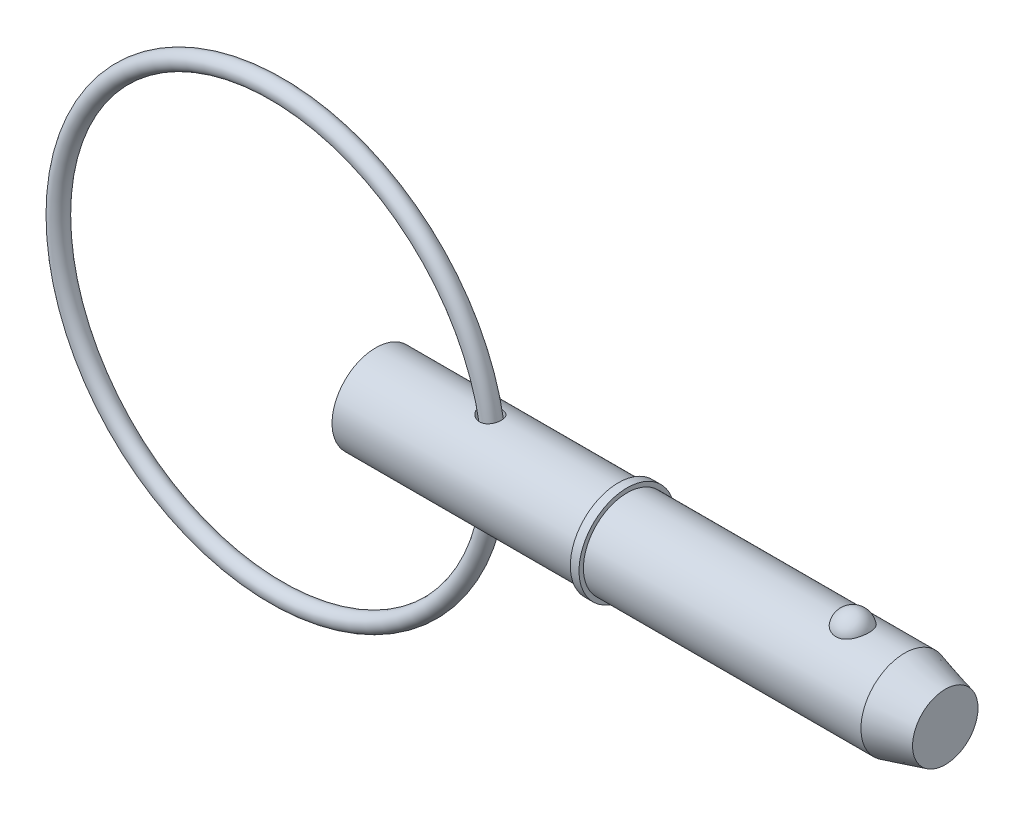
ISO-10303-21;
HEADER;
FILE_DESCRIPTION(('STEP AP214'),'2;1');
FILE_NAME('part.step','',(''),(''),'','','');
FILE_SCHEMA(('AUTOMOTIVE_DESIGN { 1 0 10303 214 1 1 1 1 }'));
ENDSEC;
DATA;
#1=APPLICATION_CONTEXT('core data for automotive mechanical design processes');
#2=APPLICATION_PROTOCOL_DEFINITION('international standard','automotive_design',2000,#1);
#3=PRODUCT_CONTEXT('',#1,'mechanical');
#4=PRODUCT('Part','Part','',(#3));
#5=PRODUCT_RELATED_PRODUCT_CATEGORY('part','',(#4));
#6=PRODUCT_DEFINITION_FORMATION('','',#4);
#7=PRODUCT_DEFINITION_CONTEXT('part definition',#1,'design');
#8=PRODUCT_DEFINITION('design','',#6,#7);
#9=PRODUCT_DEFINITION_SHAPE('','',#8);
#10=(LENGTH_UNIT() NAMED_UNIT(*) SI_UNIT(.MILLI.,.METRE.));
#11=(NAMED_UNIT(*) PLANE_ANGLE_UNIT() SI_UNIT($,.RADIAN.));
#12=(NAMED_UNIT(*) SI_UNIT($,.STERADIAN.) SOLID_ANGLE_UNIT());
#13=UNCERTAINTY_MEASURE_WITH_UNIT(LENGTH_MEASURE(1.E-05),#10,'distance_accuracy_value','');
#14=(GEOMETRIC_REPRESENTATION_CONTEXT(3) GLOBAL_UNCERTAINTY_ASSIGNED_CONTEXT((#13)) GLOBAL_UNIT_ASSIGNED_CONTEXT((#10,
#11,#12)) REPRESENTATION_CONTEXT('',''));
#15=CARTESIAN_POINT('',(0.,0.,0.));
#16=DIRECTION('',(0.,0.,1.));
#17=DIRECTION('',(1.,0.,0.));
#18=AXIS2_PLACEMENT_3D('',#15,#16,#17);
#19=CARTESIAN_POINT('',(-7.21857545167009,0.,0.));
#20=DIRECTION('',(0.,0.,1.));
#21=DIRECTION('',(1.,0.,0.));
#22=AXIS2_PLACEMENT_3D('',#19,#20,#21);
#23=TOROIDAL_SURFACE('',#22,15.875,0.634999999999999);
#24=CARTESIAN_POINT('',(9.29142454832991,0.,0.));
#25=VERTEX_POINT('',#24);
#26=VERTEX_LOOP('',#25);
#27=FACE_BOUND('',#26,.T.);
#28=ADVANCED_FACE('P0_F12',(#27),#23,.T.);
#29=CLOSED_SHELL('',(#28));
#30=MANIFOLD_SOLID_BREP('P0_B1',#29);
#31=CARTESIAN_POINT('',(0.,0.,0.));
#32=DIRECTION('',(1.,0.,0.));
#33=DIRECTION('',(0.,0.,-1.));
#34=AXIS2_PLACEMENT_3D('',#31,#32,#33);
#35=CYLINDRICAL_SURFACE('',#34,3.175);
#36=CARTESIAN_POINT('',(7.61208756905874,3.1556298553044,-0.35017883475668));
#37=CARTESIAN_POINT('',(7.63371620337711,3.15106857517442,-0.391277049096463));
#38=CARTESIAN_POINT('',(7.65900587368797,3.14590738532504,-0.430417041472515));
#39=CARTESIAN_POINT('',(7.71586762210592,3.13499707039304,-0.503788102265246));
#40=CARTESIAN_POINT('',(7.74745045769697,3.12924694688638,-0.538010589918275));
#41=CARTESIAN_POINT('',(7.81573449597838,3.11782384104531,-0.600675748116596));
#42=CARTESIAN_POINT('',(7.85242014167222,3.11215067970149,-0.629135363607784));
#43=CARTESIAN_POINT('',(7.9299616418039,3.10148180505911,-0.679784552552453));
#44=CARTESIAN_POINT('',(7.97081650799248,3.0964859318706,-0.701975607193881));
#45=CARTESIAN_POINT('',(8.05731415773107,3.08756286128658,-0.740259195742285));
#46=CARTESIAN_POINT('',(8.10308043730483,3.08368396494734,-0.756085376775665));
#47=CARTESIAN_POINT('',(8.19675033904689,3.07777545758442,-0.779791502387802));
#48=CARTESIAN_POINT('',(8.24465368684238,3.07574560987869,-0.787672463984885));
#49=CARTESIAN_POINT('',(8.33978659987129,3.07388057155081,-0.794919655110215));
#50=CARTESIAN_POINT('',(8.38699681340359,3.07398484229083,-0.794520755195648));
#51=CARTESIAN_POINT('',(8.48058476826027,3.07628376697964,-0.785572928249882));
#52=CARTESIAN_POINT('',(8.52696281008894,3.07847765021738,-0.777027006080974));
#53=CARTESIAN_POINT('',(8.61487038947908,3.08453758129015,-0.752595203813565));
#54=CARTESIAN_POINT('',(8.65652632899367,3.0883052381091,-0.737137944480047));
#55=CARTESIAN_POINT('',(8.73650065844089,3.09706199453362,-0.69943165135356));
#56=CARTESIAN_POINT('',(8.77481931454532,3.10205099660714,-0.677183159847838));
#57=CARTESIAN_POINT('',(8.84638246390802,3.11258194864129,-0.62697851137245));
#58=CARTESIAN_POINT('',(8.87970556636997,3.11811239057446,-0.599131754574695));
#59=CARTESIAN_POINT('',(8.94123162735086,3.12919300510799,-0.538266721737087));
#60=CARTESIAN_POINT('',(8.96943428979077,3.1347431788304,-0.505248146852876));
#61=CARTESIAN_POINT('',(9.02036334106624,3.14533698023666,-0.434482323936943));
#62=CARTESIAN_POINT('',(9.04301290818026,3.15037299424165,-0.396678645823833));
#63=CARTESIAN_POINT('',(9.08180072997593,3.15931021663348,-0.317742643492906));
#64=CARTESIAN_POINT('',(9.0979387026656,3.1632113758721,-0.27661017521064));
#65=CARTESIAN_POINT('',(9.12343544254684,3.16949230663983,-0.191753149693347));
#66=CARTESIAN_POINT('',(9.13272827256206,3.17185725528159,-0.148007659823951));
#67=CARTESIAN_POINT('',(9.14405176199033,3.17475043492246,-0.0595274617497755));
#68=CARTESIAN_POINT('',(9.14608246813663,3.17527867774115,-0.0147927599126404));
#69=CARTESIAN_POINT('',(9.1428335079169,3.1744420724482,0.0743443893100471));
#70=CARTESIAN_POINT('',(9.13756166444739,3.17307925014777,0.118747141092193));
#71=CARTESIAN_POINT('',(9.11985162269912,3.1686108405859,0.206009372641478));
#72=CARTESIAN_POINT('',(9.10741326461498,3.16550521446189,0.248868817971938));
#73=CARTESIAN_POINT('',(9.07566875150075,3.1578851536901,0.331849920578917));
#74=CARTESIAN_POINT('',(9.05635986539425,3.15337015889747,0.371970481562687));
#75=CARTESIAN_POINT('',(9.01134716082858,3.14342392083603,0.448324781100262));
#76=CARTESIAN_POINT('',(8.98564319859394,3.13799265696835,0.484558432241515));
#77=CARTESIAN_POINT('',(8.92847529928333,3.12681455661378,0.552114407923));
#78=CARTESIAN_POINT('',(8.89701024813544,3.12106765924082,0.583435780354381));
#79=CARTESIAN_POINT('',(8.82914631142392,3.10991074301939,0.640250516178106));
#80=CARTESIAN_POINT('',(8.79274799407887,3.10450068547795,0.665744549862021));
#81=CARTESIAN_POINT('',(8.71647895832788,3.09469918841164,0.709908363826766));
#82=CARTESIAN_POINT('',(8.6766541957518,3.09029650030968,0.728654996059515));
#83=CARTESIAN_POINT('',(8.59431583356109,3.08292493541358,0.759241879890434));
#84=CARTESIAN_POINT('',(8.55180254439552,3.07995589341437,0.771082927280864));
#85=CARTESIAN_POINT('',(8.46578539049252,3.07578939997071,0.787538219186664));
#86=CARTESIAN_POINT('',(8.42229655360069,3.07457372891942,0.792226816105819));
#87=CARTESIAN_POINT('',(8.33511786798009,3.07395008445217,0.794642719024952));
#88=CARTESIAN_POINT('',(8.29142799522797,3.07454233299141,0.792369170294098));
#89=CARTESIAN_POINT('',(8.20393675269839,3.07746038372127,0.7809593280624));
#90=CARTESIAN_POINT('',(8.16015857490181,3.07982804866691,0.771657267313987));
#91=CARTESIAN_POINT('',(8.07467704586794,3.08604667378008,0.746397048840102));
#92=CARTESIAN_POINT('',(8.03297433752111,3.08989809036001,0.730436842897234));
#93=CARTESIAN_POINT('',(7.95039160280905,3.09890222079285,0.691270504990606));
#94=CARTESIAN_POINT('',(7.90968495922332,3.10411517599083,0.667712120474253));
#95=CARTESIAN_POINT('',(7.83271969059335,3.1151281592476,0.614283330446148));
#96=CARTESIAN_POINT('',(7.79646250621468,3.12092837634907,0.584410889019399));
#97=CARTESIAN_POINT('',(7.72857688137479,3.13262084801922,0.518141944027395));
#98=CARTESIAN_POINT('',(7.69709348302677,3.13851156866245,0.481595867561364));
#99=CARTESIAN_POINT('',(7.64110131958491,3.14951669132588,0.403390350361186));
#100=CARTESIAN_POINT('',(7.61658964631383,3.15463141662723,0.361733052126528));
#101=CARTESIAN_POINT('',(7.57680170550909,3.16317869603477,0.276844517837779));
#102=CARTESIAN_POINT('',(7.56109307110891,3.16668805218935,0.233824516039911));
#103=CARTESIAN_POINT('',(7.53774475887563,3.17196948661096,0.145544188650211));
#104=CARTESIAN_POINT('',(7.53010042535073,3.17374256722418,0.100285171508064));
#105=CARTESIAN_POINT('',(7.52361520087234,3.17524561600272,0.0131362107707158));
#106=CARTESIAN_POINT('',(7.52405785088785,3.17514186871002,-0.0286991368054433));
#107=CARTESIAN_POINT('',(7.53198606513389,3.17330730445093,-0.11163297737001));
#108=CARTESIAN_POINT('',(7.53946515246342,3.17157798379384,-0.152732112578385));
#109=CARTESIAN_POINT('',(7.55761776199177,3.16747587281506,-0.220170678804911));
#110=CARTESIAN_POINT('',(7.56650761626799,3.16548510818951,-0.24703103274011));
#111=CARTESIAN_POINT('',(7.58717790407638,3.16094651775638,-0.299561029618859));
#112=CARTESIAN_POINT('',(7.59895820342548,3.15839871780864,-0.325230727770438));
#113=CARTESIAN_POINT('',(7.61208756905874,3.1556298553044,-0.35017883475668));
#114=B_SPLINE_CURVE_WITH_KNOTS('',3,(#36,#37,#38,#39,#40,#41,#42,#43,#44,#45,#46,#47,#48,#49,
#50,#51,#52,#53,#54,#55,#56,#57,#58,#59,#60,#61,#62,#63,#64,#65,#66,#67,#68,#69,#70,#71,#72,#73,
#74,#75,#76,#77,#78,#79,#80,#81,#82,#83,#84,#85,#86,#87,#88,#89,#90,#91,#92,#93,#94,#95,#96,#97,
#98,#99,#100,#101,#102,#103,#104,#105,#106,#107,#108,#109,#110,#111,#112,#113),.UNSPECIFIED.,
.T.,.F.,(4,2,2,2,2,2,2,2,2,2,2,2,2,2,2,2,2,2,2,2,2,2,2,2,2,2,2,2,2,2,2,2,2,2,2,2,2,2,4),(0.,
0.139884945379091,0.280011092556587,0.419719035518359,0.559393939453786,0.704422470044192,
0.849432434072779,0.990334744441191,1.13118510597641,1.26430449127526,1.39741324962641,
1.52813722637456,1.65886875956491,1.79131797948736,1.92377293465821,2.05748767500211,
2.19120155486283,2.32477230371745,2.45834603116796,2.5919729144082,2.72560280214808,
2.8592585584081,2.9928989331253,3.12496502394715,3.25701589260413,3.3876844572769,
3.51836906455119,3.65223598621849,3.78614411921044,3.92746618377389,4.06883388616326,
4.21388116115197,4.35886784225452,4.4959119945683,4.63287698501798,4.75777153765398,
4.88255123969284,4.9674704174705,5.05238565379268),.UNSPECIFIED.);
#115=CARTESIAN_POINT('',(7.61208756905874,3.1556298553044,-0.35017883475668));
#116=VERTEX_POINT('',#115);
#117=EDGE_CURVE('P1_E42',#116,#116,#114,.T.);
#118=ORIENTED_EDGE('',*,*,#117,.T.);
#119=EDGE_LOOP('',(#118));
#120=FACE_BOUND('',#119,.T.);
#121=CARTESIAN_POINT('',(0.,0.,0.));
#122=DIRECTION('',(1.,0.,0.));
#123=DIRECTION('',(0.,0.,-1.));
#124=AXIS2_PLACEMENT_3D('',#121,#122,#123);
#125=CIRCLE('',#124,3.175);
#126=CARTESIAN_POINT('',(0.,0.,-3.175));
#127=VERTEX_POINT('',#126);
#128=EDGE_CURVE('P1_E9',#127,#127,#125,.T.);
#129=ORIENTED_EDGE('',*,*,#128,.T.);
#130=EDGE_LOOP('',(#129));
#131=FACE_BOUND('',#130,.T.);
#132=CARTESIAN_POINT('',(17.655,0.,0.));
#133=DIRECTION('',(1.,0.,0.));
#134=DIRECTION('',(0.,0.,-1.));
#135=AXIS2_PLACEMENT_3D('',#132,#133,#134);
#136=CIRCLE('',#135,3.175);
#137=CARTESIAN_POINT('',(17.655,0.,-3.175));
#138=VERTEX_POINT('',#137);
#139=EDGE_CURVE('P1_E25',#138,#138,#136,.T.);
#140=ORIENTED_EDGE('',*,*,#139,.F.);
#141=EDGE_LOOP('',(#140));
#142=FACE_BOUND('',#141,.T.);
#143=CARTESIAN_POINT('',(7.61208756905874,-3.1556298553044,-0.35017883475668));
#144=CARTESIAN_POINT('',(7.59286963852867,-3.15968249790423,-0.313658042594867));
#145=CARTESIAN_POINT('',(7.57653057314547,-3.16326353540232,-0.275569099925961));
#146=CARTESIAN_POINT('',(7.55026251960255,-3.16911690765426,-0.197144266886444));
#147=CARTESIAN_POINT('',(7.5403309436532,-3.17138977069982,-0.156809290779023));
#148=CARTESIAN_POINT('',(7.52732229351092,-3.17438133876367,-0.0748996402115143));
#149=CARTESIAN_POINT('',(7.52425928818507,-3.17509685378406,-0.0333225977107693));
#150=CARTESIAN_POINT('',(7.52518511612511,-3.17488190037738,0.0497488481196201));
#151=CARTESIAN_POINT('',(7.52917391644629,-3.17395143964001,0.0912432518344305));
#152=CARTESIAN_POINT('',(7.5438119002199,-3.17059494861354,0.171876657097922));
#153=CARTESIAN_POINT('',(7.55428987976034,-3.16820738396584,0.211048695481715));
#154=CARTESIAN_POINT('',(7.58129107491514,-3.16221942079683,0.287144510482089));
#155=CARTESIAN_POINT('',(7.59781536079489,-3.15861880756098,0.324067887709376));
#156=CARTESIAN_POINT('',(7.63709105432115,-3.15038497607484,0.39633030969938));
#157=CARTESIAN_POINT('',(7.66007308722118,-3.14571500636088,0.431539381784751));
#158=CARTESIAN_POINT('',(7.71115516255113,-3.1358897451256,0.497945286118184));
#159=CARTESIAN_POINT('',(7.73925713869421,-3.13073427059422,0.529140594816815));
#160=CARTESIAN_POINT('',(7.80245490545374,-3.11995925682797,0.589491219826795));
#161=CARTESIAN_POINT('',(7.83794667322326,-3.11433841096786,0.618232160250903));
#162=CARTESIAN_POINT('',(7.91311816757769,-3.10367079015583,0.669735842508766));
#163=CARTESIAN_POINT('',(7.9527994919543,-3.09862423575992,0.692496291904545));
#164=CARTESIAN_POINT('',(8.0376108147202,-3.08940933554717,0.732544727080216));
#165=CARTESIAN_POINT('',(8.08291928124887,-3.08530306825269,0.749471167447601));
#166=CARTESIAN_POINT('',(8.17586222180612,-3.07887185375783,0.775470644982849));
#167=CARTESIAN_POINT('',(8.22349631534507,-3.07654661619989,0.784544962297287));
#168=CARTESIAN_POINT('',(8.31855368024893,-3.0740583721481,0.794238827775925));
#169=CARTESIAN_POINT('',(8.365955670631,-3.0738459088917,0.795051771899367));
#170=CARTESIAN_POINT('',(8.46014660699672,-3.07554059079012,0.788471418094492));
#171=CARTESIAN_POINT('',(8.50693577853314,-3.07744693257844,0.781081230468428));
#172=CARTESIAN_POINT('',(8.59580031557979,-3.08301185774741,0.75880456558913));
#173=CARTESIAN_POINT('',(8.63799306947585,-3.0865668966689,0.744358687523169));
#174=CARTESIAN_POINT('',(8.71919510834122,-3.09498125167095,0.708556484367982));
#175=CARTESIAN_POINT('',(8.75820469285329,-3.09984044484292,0.687200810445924));
#176=CARTESIAN_POINT('',(8.83112932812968,-3.11018970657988,0.638704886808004));
#177=CARTESIAN_POINT('',(8.86513521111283,-3.11566412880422,0.6116975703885));
#178=CARTESIAN_POINT('',(8.92814452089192,-3.1267232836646,0.552389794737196));
#179=CARTESIAN_POINT('',(8.95714769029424,-3.13230802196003,0.520089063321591));
#180=CARTESIAN_POINT('',(9.00975680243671,-3.1430519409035,0.450661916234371));
#181=CARTESIAN_POINT('',(9.03329284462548,-3.14820512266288,0.413481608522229));
#182=CARTESIAN_POINT('',(9.07393955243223,-3.15745247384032,0.335639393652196));
#183=CARTESIAN_POINT('',(9.09104990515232,-3.16154659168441,0.294977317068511));
#184=CARTESIAN_POINT('',(9.11857731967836,-3.16827429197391,0.21085639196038));
#185=CARTESIAN_POINT('',(9.12892253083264,-3.1708921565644,0.167372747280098));
#186=CARTESIAN_POINT('',(9.14237674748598,-3.17431758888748,0.0792307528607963));
#187=CARTESIAN_POINT('',(9.14548579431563,-3.17512516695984,0.0345724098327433));
#188=CARTESIAN_POINT('',(9.14439142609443,-3.17484319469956,-0.0546175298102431));
#189=CARTESIAN_POINT('',(9.14019308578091,-3.17375496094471,-0.0991491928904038));
#190=CARTESIAN_POINT('',(9.12459742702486,-3.16980106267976,-0.186852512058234));
#191=CARTESIAN_POINT('',(9.11319997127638,-3.16693536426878,-0.230024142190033));
#192=CARTESIAN_POINT('',(9.08348483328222,-3.15973571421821,-0.313789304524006));
#193=CARTESIAN_POINT('',(9.06516665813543,-3.15540165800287,-0.354382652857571));
#194=CARTESIAN_POINT('',(9.02205745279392,-3.14573679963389,-0.431845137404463));
#195=CARTESIAN_POINT('',(8.99726624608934,-3.14040597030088,-0.468714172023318));
#196=CARTESIAN_POINT('',(8.94180687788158,-3.12933254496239,-0.53770470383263));
#197=CARTESIAN_POINT('',(8.91113471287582,-3.12358967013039,-0.569822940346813));
#198=CARTESIAN_POINT('',(8.84472020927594,-3.11234460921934,-0.628352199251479));
#199=CARTESIAN_POINT('',(8.80897839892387,-3.10684239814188,-0.654763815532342));
#200=CARTESIAN_POINT('',(8.73381844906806,-3.0967672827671,-0.700864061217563));
#201=CARTESIAN_POINT('',(8.69444454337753,-3.09218491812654,-0.720622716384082));
#202=CARTESIAN_POINT('',(8.61282389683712,-3.08439406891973,-0.75327416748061));
#203=CARTESIAN_POINT('',(8.57057751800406,-3.08118541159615,-0.766167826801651));
#204=CARTESIAN_POINT('',(8.48495851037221,-3.07651651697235,-0.784705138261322));
#205=CARTESIAN_POINT('',(8.44160497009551,-3.07503616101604,-0.7904322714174));
#206=CARTESIAN_POINT('',(8.35452054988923,-3.07388232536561,-0.794907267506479));
#207=CARTESIAN_POINT('',(8.31078963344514,-3.07420902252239,-0.793654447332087));
#208=CARTESIAN_POINT('',(8.22319164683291,-3.07661365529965,-0.784281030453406));
#209=CARTESIAN_POINT('',(8.17934121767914,-3.07872844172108,-0.776015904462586));
#210=CARTESIAN_POINT('',(8.09354825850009,-3.08448489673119,-0.752807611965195));
#211=CARTESIAN_POINT('',(8.05160636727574,-3.08812707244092,-0.737862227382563));
#212=CARTESIAN_POINT('',(7.9683964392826,-3.09676294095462,-0.700760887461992));
#213=CARTESIAN_POINT('',(7.92729071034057,-3.10181965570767,-0.678255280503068));
#214=CARTESIAN_POINT('',(7.84934481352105,-3.11260576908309,-0.626894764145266));
#215=CARTESIAN_POINT('',(7.81250545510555,-3.11833529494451,-0.598038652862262));
#216=CARTESIAN_POINT('',(7.74486652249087,-3.12971026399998,-0.535287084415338));
#217=CARTESIAN_POINT('',(7.71395414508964,-3.13535486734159,-0.50151327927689));
#218=CARTESIAN_POINT('',(7.65821444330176,-3.14606907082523,-0.429192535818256));
#219=CARTESIAN_POINT('',(7.63338346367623,-3.15113901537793,-0.390648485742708));
#220=CARTESIAN_POINT('',(7.61208756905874,-3.1556298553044,-0.35017883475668));
#221=B_SPLINE_CURVE_WITH_KNOTS('',3,(#143,#144,#145,#146,#147,#148,#149,#150,#151,#152,#153,
#154,#155,#156,#157,#158,#159,#160,#161,#162,#163,#164,#165,#166,#167,#168,#169,#170,#171,#172,
#173,#174,#175,#176,#177,#178,#179,#180,#181,#182,#183,#184,#185,#186,#187,#188,#189,#190,#191,
#192,#193,#194,#195,#196,#197,#198,#199,#200,#201,#202,#203,#204,#205,#206,#207,#208,#209,#210,
#211,#212,#213,#214,#215,#216,#217,#218,#219,#220),.UNSPECIFIED.,.T.,.F.,(4,2,2,2,2,2,2,2,2,2,2,
2,2,2,2,2,2,2,2,2,2,2,2,2,2,2,2,2,2,2,2,2,2,2,2,2,2,2,4),(0.,0.124257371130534,0.24846452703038,
0.372925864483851,0.497386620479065,0.618695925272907,0.740026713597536,0.86640919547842,
0.992839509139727,1.13028244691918,1.26777799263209,1.41269245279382,1.55758328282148,
1.69907422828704,1.84051154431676,1.97406862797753,2.10761312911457,2.23831247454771,
2.36901854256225,2.5013136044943,2.63361510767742,2.76729986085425,2.90098385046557,
3.03457503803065,3.16816877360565,3.3017720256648,3.43537892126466,3.56907709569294,
3.70276134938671,3.83499098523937,3.96720398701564,4.09786208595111,4.22853297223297,
4.36196440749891,4.49544017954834,4.63621591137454,4.77701830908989,4.91479418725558,
5.05248705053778),.UNSPECIFIED.);
#222=CARTESIAN_POINT('',(7.61208756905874,-3.1556298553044,-0.35017883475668));
#223=VERTEX_POINT('',#222);
#224=EDGE_CURVE('P1_E17',#223,#223,#221,.T.);
#225=ORIENTED_EDGE('',*,*,#224,.T.);
#226=EDGE_LOOP('',(#225));
#227=FACE_BOUND('',#226,.T.);
#228=ADVANCED_FACE('P1_F13',(#120,#131,#142,#227),#35,.T.);
#229=CARTESIAN_POINT('',(0.,0.,0.));
#230=DIRECTION('',(1.,0.,0.));
#231=DIRECTION('',(0.,0.,-1.));
#232=AXIS2_PLACEMENT_3D('',#229,#230,#231);
#233=CYLINDRICAL_SURFACE('',#232,3.175);
#234=CARTESIAN_POINT('',(38.4876846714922,0.,0.));
#235=DIRECTION('',(1.,0.,0.));
#236=DIRECTION('',(0.,0.,-1.));
#237=AXIS2_PLACEMENT_3D('',#234,#235,#236);
#238=CIRCLE('',#237,3.175);
#239=CARTESIAN_POINT('',(38.4876846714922,0.,-3.175));
#240=VERTEX_POINT('',#239);
#241=EDGE_CURVE('P1_E99',#240,#240,#238,.T.);
#242=ORIENTED_EDGE('',*,*,#241,.F.);
#243=EDGE_LOOP('',(#242));
#244=FACE_BOUND('',#243,.T.);
#245=CARTESIAN_POINT('',(18.29,0.,0.));
#246=DIRECTION('',(1.,0.,0.));
#247=DIRECTION('',(0.,0.,-1.));
#248=AXIS2_PLACEMENT_3D('',#245,#246,#247);
#249=CIRCLE('',#248,3.175);
#250=CARTESIAN_POINT('',(18.29,0.,-3.175));
#251=VERTEX_POINT('',#250);
#252=EDGE_CURVE('P1_E96',#251,#251,#249,.T.);
#253=ORIENTED_EDGE('',*,*,#252,.T.);
#254=EDGE_LOOP('',(#253));
#255=FACE_BOUND('',#254,.T.);
#256=CARTESIAN_POINT('',(34.7157276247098,2.92898950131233,1.2254164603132));
#257=CARTESIAN_POINT('',(34.652316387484,2.92899434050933,1.22541146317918));
#258=CARTESIAN_POINT('',(34.5887979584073,2.93112688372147,1.2203464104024));
#259=CARTESIAN_POINT('',(34.4635306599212,2.93942752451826,1.20020949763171));
#260=CARTESIAN_POINT('',(34.4017869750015,2.9456063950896,1.1851109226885));
#261=CARTESIAN_POINT('',(34.2820651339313,2.96127115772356,1.14540352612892));
#262=CARTESIAN_POINT('',(34.2240775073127,2.97074831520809,1.12081980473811));
#263=CARTESIAN_POINT('',(34.1131943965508,2.99197584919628,1.06285154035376));
#264=CARTESIAN_POINT('',(34.0602966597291,3.0037252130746,1.02947091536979));
#265=CARTESIAN_POINT('',(33.9592688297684,3.02865714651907,0.95367409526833));
#266=CARTESIAN_POINT('',(33.9113240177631,3.04187163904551,0.911021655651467));
#267=CARTESIAN_POINT('',(33.8230360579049,3.06808741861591,0.818400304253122));
#268=CARTESIAN_POINT('',(33.7826952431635,3.08108863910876,0.768429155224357));
#269=CARTESIAN_POINT('',(33.7088039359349,3.10614903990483,0.660064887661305));
#270=CARTESIAN_POINT('',(33.6756330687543,3.11814104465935,0.601396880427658));
#271=CARTESIAN_POINT('',(33.6191190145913,3.13926931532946,0.479026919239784));
#272=CARTESIAN_POINT('',(33.5957764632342,3.14840539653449,0.415324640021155));
#273=CARTESIAN_POINT('',(33.5591785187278,3.16298160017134,0.283885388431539));
#274=CARTESIAN_POINT('',(33.5460407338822,3.16837855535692,0.216110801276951));
#275=CARTESIAN_POINT('',(33.5305676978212,3.17475386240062,0.0791367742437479));
#276=CARTESIAN_POINT('',(33.528232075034,3.17573236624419,0.00993738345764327));
#277=CARTESIAN_POINT('',(33.5343886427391,3.17318075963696,-0.127420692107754));
#278=CARTESIAN_POINT('',(33.5428073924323,3.16968122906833,-0.195583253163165));
#279=CARTESIAN_POINT('',(33.5701752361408,3.1585790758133,-0.329413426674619));
#280=CARTESIAN_POINT('',(33.5891245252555,3.15097637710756,-0.395080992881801));
#281=CARTESIAN_POINT('',(33.6372057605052,3.13242485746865,-0.522180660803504));
#282=CARTESIAN_POINT('',(33.6663524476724,3.12147119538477,-0.58360647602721));
#283=CARTESIAN_POINT('',(33.7342352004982,3.09734973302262,-0.700436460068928));
#284=CARTESIAN_POINT('',(33.772972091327,3.08418174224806,-0.7558401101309));
#285=CARTESIAN_POINT('',(33.8594771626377,3.05694884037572,-0.859404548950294));
#286=CARTESIAN_POINT('',(33.9072961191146,3.04287919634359,-0.907521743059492));
#287=CARTESIAN_POINT('',(34.0107353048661,3.01548927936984,-0.994758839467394));
#288=CARTESIAN_POINT('',(34.0663549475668,3.0021689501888,-1.03387941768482));
#289=CARTESIAN_POINT('',(34.1828093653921,2.97810316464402,-1.10126594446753));
#290=CARTESIAN_POINT('',(34.2435182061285,2.96731170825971,-1.12973256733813));
#291=CARTESIAN_POINT('',(34.3693712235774,2.9492893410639,-1.17598467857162));
#292=CARTESIAN_POINT('',(34.4345137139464,2.94205708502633,-1.19377420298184));
#293=CARTESIAN_POINT('',(34.5638562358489,2.93233065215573,-1.21746387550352));
#294=CARTESIAN_POINT('',(34.6279385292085,2.92961621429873,-1.22391763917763));
#295=CARTESIAN_POINT('',(34.7563375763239,2.92855752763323,-1.22644976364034));
#296=CARTESIAN_POINT('',(34.8206542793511,2.93021238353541,-1.22253024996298));
#297=CARTESIAN_POINT('',(34.9455239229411,2.9375685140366,-1.20474140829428));
#298=CARTESIAN_POINT('',(35.006131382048,2.94313790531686,-1.19119621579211));
#299=CARTESIAN_POINT('',(35.1241106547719,2.95756226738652,-1.15491492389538));
#300=CARTESIAN_POINT('',(35.1814822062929,2.96641750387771,-1.13217808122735));
#301=CARTESIAN_POINT('',(35.2927699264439,2.98669918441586,-1.07755083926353));
#302=CARTESIAN_POINT('',(35.3465845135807,2.9981771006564,-1.0454730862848));
#303=CARTESIAN_POINT('',(35.4481473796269,3.02240235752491,-0.973220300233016));
#304=CARTESIAN_POINT('',(35.4958942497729,3.03514999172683,-0.933043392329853));
#305=CARTESIAN_POINT('',(35.5865817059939,3.06131230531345,-0.843372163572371));
#306=CARTESIAN_POINT('',(35.6291588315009,3.07472822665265,-0.793510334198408));
#307=CARTESIAN_POINT('',(35.7056765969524,3.10021106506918,-0.687241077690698));
#308=CARTESIAN_POINT('',(35.7396156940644,3.1122777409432,-0.630832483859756));
#309=CARTESIAN_POINT('',(35.7991209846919,3.134208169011,-0.511059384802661));
#310=CARTESIAN_POINT('',(35.8243892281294,3.14399040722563,-0.447531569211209));
#311=CARTESIAN_POINT('',(35.8645117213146,3.15983820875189,-0.316827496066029));
#312=CARTESIAN_POINT('',(35.8793659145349,3.16590375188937,-0.249651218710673));
#313=CARTESIAN_POINT('',(35.898358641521,3.17370076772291,-0.11354918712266));
#314=CARTESIAN_POINT('',(35.9024966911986,3.17543204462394,-0.0446233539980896));
#315=CARTESIAN_POINT('',(35.8999697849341,3.17438372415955,0.0929938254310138));
#316=CARTESIAN_POINT('',(35.8933050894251,3.17160423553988,0.161685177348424));
#317=CARTESIAN_POINT('',(35.8693754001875,3.1618438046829,0.29650259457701));
#318=CARTESIAN_POINT('',(35.8521674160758,3.15488546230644,0.362640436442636));
#319=CARTESIAN_POINT('',(35.8075470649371,3.13748892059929,0.490896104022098));
#320=CARTESIAN_POINT('',(35.7801339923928,3.12705048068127,0.553013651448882));
#321=CARTESIAN_POINT('',(35.7154626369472,3.10369139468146,0.671876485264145));
#322=CARTESIAN_POINT('',(35.6781467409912,3.0907563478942,0.728587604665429));
#323=CARTESIAN_POINT('',(35.5945246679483,3.06381731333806,0.834653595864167));
#324=CARTESIAN_POINT('',(35.5482189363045,3.04981337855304,0.88400883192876));
#325=CARTESIAN_POINT('',(35.4477184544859,3.02230423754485,0.973916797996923));
#326=CARTESIAN_POINT('',(35.393535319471,3.00879833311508,1.01448227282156));
#327=CARTESIAN_POINT('',(35.2785299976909,2.98383625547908,1.0857155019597));
#328=CARTESIAN_POINT('',(35.2177053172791,2.9723808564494,1.11637952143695));
#329=CARTESIAN_POINT('',(35.0933690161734,2.95329063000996,1.16592590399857));
#330=CARTESIAN_POINT('',(35.0300230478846,2.9455373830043,1.18517901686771));
#331=CARTESIAN_POINT('',(34.9007664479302,2.9342556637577,1.21284802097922));
#332=CARTESIAN_POINT('',(34.8348641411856,2.93071450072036,1.2212964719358));
#333=CARTESIAN_POINT('',(34.751116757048,2.9291525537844,1.22502505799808));
#334=CARTESIAN_POINT('',(34.7334263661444,2.92898815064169,1.22541785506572));
#335=CARTESIAN_POINT('',(34.7157276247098,2.92898950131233,1.2254164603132));
#336=B_SPLINE_CURVE_WITH_KNOTS('',3,(#256,#257,#258,#259,#260,#261,#262,#263,#264,#265,#266,
#267,#268,#269,#270,#271,#272,#273,#274,#275,#276,#277,#278,#279,#280,#281,#282,#283,#284,#285,
#286,#287,#288,#289,#290,#291,#292,#293,#294,#295,#296,#297,#298,#299,#300,#301,#302,#303,#304,
#305,#306,#307,#308,#309,#310,#311,#312,#313,#314,#315,#316,#317,#318,#319,#320,#321,#322,#323,
#324,#325,#326,#327,#328,#329,#330,#331,#332,#333,#334,#335),.UNSPECIFIED.,.T.,.F.,(4,2,2,2,2,2,
2,2,2,2,2,2,2,2,2,2,2,2,2,2,2,2,2,2,2,2,2,2,2,2,2,2,2,2,2,2,2,2,2,4),(0.,0.190186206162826,
0.380880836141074,0.571074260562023,0.761183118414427,0.956866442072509,1.1526097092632,
1.35701770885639,1.56143892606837,1.76818248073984,1.97491892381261,2.18025109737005,
2.38558707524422,2.59122111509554,2.79687285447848,3.00371012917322,3.21053185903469,
3.41323429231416,3.61586005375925,3.80828192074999,4.00066436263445,4.18685798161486,
4.37306665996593,4.56330302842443,4.75358348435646,4.95345287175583,5.15335793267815,
5.35957003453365,5.56578325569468,5.7720057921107,5.97822335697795,6.18333558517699,
6.38846199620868,6.59480900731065,6.80114579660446,7.00718137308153,7.21329457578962,
7.41228022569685,7.61066481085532,7.66374777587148),.UNSPECIFIED.);
#337=CARTESIAN_POINT('',(34.7157276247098,2.92898950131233,1.2254164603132));
#338=VERTEX_POINT('',#337);
#339=EDGE_CURVE('P1_E34',#338,#338,#336,.T.);
#340=ORIENTED_EDGE('',*,*,#339,.T.);
#341=EDGE_LOOP('',(#340));
#342=FACE_BOUND('',#341,.T.);
#343=ADVANCED_FACE('P1_F46',(#244,#255,#342),#233,.T.);
#344=CARTESIAN_POINT('',(0.,0.,0.));
#345=DIRECTION('',(-1.,0.,0.));
#346=DIRECTION('',(0.,0.,1.));
#347=AXIS2_PLACEMENT_3D('',#344,#345,#346);
#348=PLANE('',#347);
#349=ORIENTED_EDGE('',*,*,#128,.F.);
#350=EDGE_LOOP('',(#349));
#351=FACE_BOUND('',#350,.T.);
#352=ADVANCED_FACE('P1_F15',(#351),#348,.T.);
#353=CARTESIAN_POINT('',(17.655,3.175,0.));
#354=DIRECTION('',(-1.,0.,0.));
#355=DIRECTION('',(0.,0.,1.));
#356=AXIS2_PLACEMENT_3D('',#353,#354,#355);
#357=PLANE('',#356);
#358=ORIENTED_EDGE('',*,*,#139,.T.);
#359=EDGE_LOOP('',(#358));
#360=FACE_BOUND('',#359,.T.);
#361=CARTESIAN_POINT('',(17.655,0.,0.));
#362=DIRECTION('',(1.,0.,0.));
#363=DIRECTION('',(0.,0.,-1.));
#364=AXIS2_PLACEMENT_3D('',#361,#362,#363);
#365=CIRCLE('',#364,3.4925);
#366=CARTESIAN_POINT('',(17.655,0.,-3.4925));
#367=VERTEX_POINT('',#366);
#368=EDGE_CURVE('P1_E30',#367,#367,#365,.T.);
#369=ORIENTED_EDGE('',*,*,#368,.F.);
#370=EDGE_LOOP('',(#369));
#371=FACE_BOUND('',#370,.T.);
#372=ADVANCED_FACE('P1_F81',(#360,#371),#357,.T.);
#373=CARTESIAN_POINT('',(0.,0.,0.));
#374=DIRECTION('',(1.,0.,0.));
#375=DIRECTION('',(0.,0.,-1.));
#376=AXIS2_PLACEMENT_3D('',#373,#374,#375);
#377=CYLINDRICAL_SURFACE('',#376,3.4925);
#378=ORIENTED_EDGE('',*,*,#368,.T.);
#379=EDGE_LOOP('',(#378));
#380=FACE_BOUND('',#379,.T.);
#381=CARTESIAN_POINT('',(18.29,0.,0.));
#382=DIRECTION('',(1.,0.,0.));
#383=DIRECTION('',(0.,0.,-1.));
#384=AXIS2_PLACEMENT_3D('',#381,#382,#383);
#385=CIRCLE('',#384,3.4925);
#386=CARTESIAN_POINT('',(18.29,0.,-3.4925));
#387=VERTEX_POINT('',#386);
#388=EDGE_CURVE('P1_E95',#387,#387,#385,.T.);
#389=ORIENTED_EDGE('',*,*,#388,.F.);
#390=EDGE_LOOP('',(#389));
#391=FACE_BOUND('',#390,.T.);
#392=ADVANCED_FACE('P1_F68',(#380,#391),#377,.T.);
#393=CARTESIAN_POINT('',(18.29,3.4925,0.));
#394=DIRECTION('',(1.,0.,0.));
#395=DIRECTION('',(0.,0.,-1.));
#396=AXIS2_PLACEMENT_3D('',#393,#394,#395);
#397=PLANE('',#396);
#398=ORIENTED_EDGE('',*,*,#388,.T.);
#399=EDGE_LOOP('',(#398));
#400=FACE_BOUND('',#399,.T.);
#401=ORIENTED_EDGE('',*,*,#252,.F.);
#402=EDGE_LOOP('',(#401));
#403=FACE_BOUND('',#402,.T.);
#404=ADVANCED_FACE('P1_F62',(#400,#403),#397,.T.);
#405=CARTESIAN_POINT('',(41.45,0.,0.));
#406=DIRECTION('',(-1.,0.,0.));
#407=DIRECTION('',(0.,0.,1.));
#408=AXIS2_PLACEMENT_3D('',#405,#406,#407);
#409=CONICAL_SURFACE('',#408,2.38125,0.26179938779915);
#410=ORIENTED_EDGE('',*,*,#241,.T.);
#411=EDGE_LOOP('',(#410));
#412=FACE_BOUND('',#411,.T.);
#413=CARTESIAN_POINT('',(41.45,0.,0.));
#414=DIRECTION('',(1.,0.,0.));
#415=DIRECTION('',(0.,0.,-1.));
#416=AXIS2_PLACEMENT_3D('',#413,#414,#415);
#417=CIRCLE('',#416,2.38125);
#418=CARTESIAN_POINT('',(41.45,0.,-2.38125));
#419=VERTEX_POINT('',#418);
#420=EDGE_CURVE('P1_E41',#419,#419,#417,.T.);
#421=ORIENTED_EDGE('',*,*,#420,.F.);
#422=EDGE_LOOP('',(#421));
#423=FACE_BOUND('',#422,.T.);
#424=ADVANCED_FACE('P1_F59',(#412,#423),#409,.T.);
#425=CARTESIAN_POINT('',(41.45,2.38125,0.));
#426=DIRECTION('',(1.,0.,0.));
#427=DIRECTION('',(0.,0.,-1.));
#428=AXIS2_PLACEMENT_3D('',#425,#426,#427);
#429=PLANE('',#428);
#430=ORIENTED_EDGE('',*,*,#420,.T.);
#431=EDGE_LOOP('',(#430));
#432=FACE_BOUND('',#431,.T.);
#433=ADVANCED_FACE('P1_F55',(#432),#429,.T.);
#434=CARTESIAN_POINT('',(34.7157276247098,2.85749999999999,0.));
#435=DIRECTION('',(-1.,0.,0.));
#436=DIRECTION('',(0.,1.,0.));
#437=AXIS2_PLACEMENT_3D('',#434,#435,#436);
#438=SPHERICAL_SURFACE('',#437,1.22750000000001);
#439=ORIENTED_EDGE('',*,*,#339,.F.);
#440=EDGE_LOOP('',(#439));
#441=FACE_BOUND('',#440,.T.);
#442=ADVANCED_FACE('P1_F50',(#441),#438,.T.);
#443=CARTESIAN_POINT('',(-7.21857545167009,0.,0.));
#444=DIRECTION('',(0.,0.,1.));
#445=DIRECTION('',(1.,0.,0.));
#446=AXIS2_PLACEMENT_3D('',#443,#444,#445);
#447=TOROIDAL_SURFACE('',#446,15.875,0.793749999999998);
#448=ORIENTED_EDGE('',*,*,#224,.F.);
#449=EDGE_LOOP('',(#448));
#450=FACE_BOUND('',#449,.T.);
#451=ORIENTED_EDGE('',*,*,#117,.F.);
#452=EDGE_LOOP('',(#451));
#453=FACE_BOUND('',#452,.T.);
#454=ADVANCED_FACE('P1_F54',(#450,#453),#447,.F.);
#455=CLOSED_SHELL('',(#228,#343,#352,#372,#392,#404,#424,#433,#442,#454));
#456=MANIFOLD_SOLID_BREP('P1_B1',#455);
#457=ADVANCED_BREP_SHAPE_REPRESENTATION('',(#18,#30,#456),#14);
#458=SHAPE_DEFINITION_REPRESENTATION(#9,#457);
ENDSEC;
END-ISO-10303-21;
